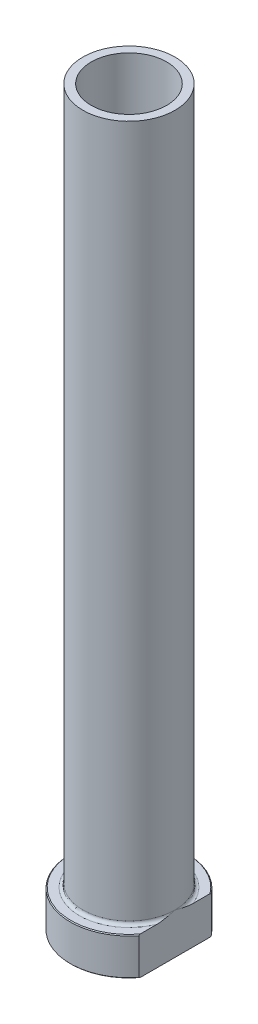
ISO-10303-21;
HEADER;
FILE_DESCRIPTION(('STEP AP214'),'2;1');
FILE_NAME('part.step','',(''),(''),'','','');
FILE_SCHEMA(('AUTOMOTIVE_DESIGN { 1 0 10303 214 1 1 1 1 }'));
ENDSEC;
DATA;
#1=APPLICATION_CONTEXT('core data for automotive mechanical design processes');
#2=APPLICATION_PROTOCOL_DEFINITION('international standard','automotive_design',2000,#1);
#3=PRODUCT_CONTEXT('',#1,'mechanical');
#4=PRODUCT('Part','Part','',(#3));
#5=PRODUCT_RELATED_PRODUCT_CATEGORY('part','',(#4));
#6=PRODUCT_DEFINITION_FORMATION('','',#4);
#7=PRODUCT_DEFINITION_CONTEXT('part definition',#1,'design');
#8=PRODUCT_DEFINITION('design','',#6,#7);
#9=PRODUCT_DEFINITION_SHAPE('','',#8);
#10=(LENGTH_UNIT() NAMED_UNIT(*) SI_UNIT(.MILLI.,.METRE.));
#11=(NAMED_UNIT(*) PLANE_ANGLE_UNIT() SI_UNIT($,.RADIAN.));
#12=(NAMED_UNIT(*) SI_UNIT($,.STERADIAN.) SOLID_ANGLE_UNIT());
#13=UNCERTAINTY_MEASURE_WITH_UNIT(LENGTH_MEASURE(1.E-05),#10,'distance_accuracy_value','');
#14=(GEOMETRIC_REPRESENTATION_CONTEXT(3) GLOBAL_UNCERTAINTY_ASSIGNED_CONTEXT((#13)) GLOBAL_UNIT_ASSIGNED_CONTEXT((#10,
#11,#12)) REPRESENTATION_CONTEXT('',''));
#15=CARTESIAN_POINT('',(0.,0.,0.));
#16=DIRECTION('',(0.,0.,1.));
#17=DIRECTION('',(1.,0.,0.));
#18=AXIS2_PLACEMENT_3D('',#15,#16,#17);
#19=CARTESIAN_POINT('',(0.,92.1876809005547,0.));
#20=DIRECTION('',(0.,1.,0.));
#21=DIRECTION('',(0.,0.,1.));
#22=AXIS2_PLACEMENT_3D('',#19,#20,#21);
#23=CYLINDRICAL_SURFACE('',#22,9.);
#24=CARTESIAN_POINT('',(0.,175.,0.));
#25=DIRECTION('',(0.,1.,0.));
#26=DIRECTION('',(0.,0.,1.));
#27=AXIS2_PLACEMENT_3D('',#24,#25,#26);
#28=CIRCLE('',#27,9.);
#29=CARTESIAN_POINT('',(0.,175.,9.));
#30=VERTEX_POINT('',#29);
#31=EDGE_CURVE('E167',#30,#30,#28,.T.);
#32=ORIENTED_EDGE('',*,*,#31,.T.);
#33=EDGE_LOOP('',(#32));
#34=FACE_BOUND('',#33,.T.);
#35=CARTESIAN_POINT('',(0.,120.,0.));
#36=DIRECTION('',(0.,1.,0.));
#37=DIRECTION('',(0.,0.,1.));
#38=AXIS2_PLACEMENT_3D('',#35,#36,#37);
#39=CIRCLE('',#38,9.);
#40=CARTESIAN_POINT('',(0.,120.,9.));
#41=VERTEX_POINT('',#40);
#42=EDGE_CURVE('E170',#41,#41,#39,.T.);
#43=ORIENTED_EDGE('',*,*,#42,.F.);
#44=EDGE_LOOP('',(#43));
#45=FACE_BOUND('',#44,.T.);
#46=ADVANCED_FACE('F32',(#34,#45),#23,.F.);
#47=CARTESIAN_POINT('',(-9.,175.,0.));
#48=DIRECTION('',(0.,1.,0.));
#49=DIRECTION('',(0.,0.,1.));
#50=AXIS2_PLACEMENT_3D('',#47,#48,#49);
#51=PLANE('',#50);
#52=CARTESIAN_POINT('',(0.,175.,0.));
#53=DIRECTION('',(0.,1.,0.));
#54=DIRECTION('',(0.,0.,1.));
#55=AXIS2_PLACEMENT_3D('',#52,#53,#54);
#56=CIRCLE('',#55,11.);
#57=CARTESIAN_POINT('',(0.,175.,11.));
#58=VERTEX_POINT('',#57);
#59=EDGE_CURVE('E174',#58,#58,#56,.T.);
#60=ORIENTED_EDGE('',*,*,#59,.T.);
#61=EDGE_LOOP('',(#60));
#62=FACE_BOUND('',#61,.T.);
#63=ORIENTED_EDGE('',*,*,#31,.F.);
#64=EDGE_LOOP('',(#63));
#65=FACE_BOUND('',#64,.T.);
#66=ADVANCED_FACE('F157',(#62,#65),#51,.T.);
#67=CARTESIAN_POINT('',(0.,92.1876809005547,0.));
#68=DIRECTION('',(0.,1.,0.));
#69=DIRECTION('',(0.,0.,1.));
#70=AXIS2_PLACEMENT_3D('',#67,#68,#69);
#71=CYLINDRICAL_SURFACE('',#70,11.);
#72=CARTESIAN_POINT('',(0.,9.8,0.));
#73=DIRECTION('',(0.,1.,0.));
#74=DIRECTION('',(0.,0.,1.));
#75=AXIS2_PLACEMENT_3D('',#72,#73,#74);
#76=CIRCLE('',#75,11.);
#77=CARTESIAN_POINT('',(11.,9.8,0.));
#78=VERTEX_POINT('',#77);
#79=EDGE_CURVE('E180',#78,#78,#76,.T.);
#80=ORIENTED_EDGE('',*,*,#79,.T.);
#81=EDGE_LOOP('',(#80));
#82=FACE_BOUND('',#81,.T.);
#83=ORIENTED_EDGE('',*,*,#59,.F.);
#84=EDGE_LOOP('',(#83));
#85=FACE_BOUND('',#84,.T.);
#86=ADVANCED_FACE('F162',(#82,#85),#71,.T.);
#87=CARTESIAN_POINT('',(-11.,9.,0.));
#88=DIRECTION('',(0.,1.,0.));
#89=DIRECTION('',(0.,0.,1.));
#90=AXIS2_PLACEMENT_3D('',#87,#88,#89);
#91=PLANE('',#90);
#92=DIRECTION('',(0.,0.,1.));
#93=VECTOR('',#92,1.);
#94=CARTESIAN_POINT('',(11.,9.,0.));
#95=LINE('',#94,#93);
#96=CARTESIAN_POINT('',(11.,9.,-8.33306666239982));
#97=VERTEX_POINT('',#96);
#98=CARTESIAN_POINT('',(11.,9.,-4.27083130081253));
#99=VERTEX_POINT('',#98);
#100=EDGE_CURVE('E54',#97,#99,#95,.T.);
#101=ORIENTED_EDGE('',*,*,#100,.F.);
#102=CARTESIAN_POINT('',(0.,9.,0.));
#103=DIRECTION('',(0.,1.,0.));
#104=DIRECTION('',(0.,0.,1.));
#105=AXIS2_PLACEMENT_3D('',#102,#103,#104);
#106=CIRCLE('',#105,13.8);
#107=CARTESIAN_POINT('',(11.,9.,8.33306666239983));
#108=VERTEX_POINT('',#107);
#109=EDGE_CURVE('E186',#97,#108,#106,.T.);
#110=ORIENTED_EDGE('',*,*,#109,.T.);
#111=CARTESIAN_POINT('',(11.,9.,4.27083130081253));
#112=VERTEX_POINT('',#111);
#113=EDGE_CURVE('E134',#112,#108,#95,.T.);
#114=ORIENTED_EDGE('',*,*,#113,.F.);
#115=CARTESIAN_POINT('',(0.,9.,0.));
#116=DIRECTION('',(0.,1.,0.));
#117=DIRECTION('',(0.,0.,1.));
#118=AXIS2_PLACEMENT_3D('',#115,#116,#117);
#119=CIRCLE('',#118,11.8);
#120=EDGE_CURVE('E183',#112,#99,#119,.F.);
#121=ORIENTED_EDGE('',*,*,#120,.T.);
#122=EDGE_LOOP('',(#101,#110,#114,#121));
#123=FACE_BOUND('',#122,.T.);
#124=ADVANCED_FACE('F197',(#123),#91,.T.);
#125=CARTESIAN_POINT('',(0.,92.1876809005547,0.));
#126=DIRECTION('',(0.,1.,0.));
#127=DIRECTION('',(0.,0.,1.));
#128=AXIS2_PLACEMENT_3D('',#125,#126,#127);
#129=CYLINDRICAL_SURFACE('',#128,14.);
#130=DIRECTION('',(0.,-1.,0.));
#131=VECTOR('',#130,1.);
#132=CARTESIAN_POINT('',(11.,175.,8.66025403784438));
#133=LINE('',#132,#131);
#134=CARTESIAN_POINT('',(11.,8.8,8.66025403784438));
#135=VERTEX_POINT('',#134);
#136=CARTESIAN_POINT('',(11.,0.200000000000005,8.66025403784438));
#137=VERTEX_POINT('',#136);
#138=EDGE_CURVE('E82',#135,#137,#133,.T.);
#139=ORIENTED_EDGE('',*,*,#138,.F.);
#140=CARTESIAN_POINT('',(0.,8.8,0.));
#141=DIRECTION('',(0.,1.,0.));
#142=DIRECTION('',(0.,0.,1.));
#143=AXIS2_PLACEMENT_3D('',#140,#141,#142);
#144=CIRCLE('',#143,14.);
#145=CARTESIAN_POINT('',(11.,8.8,-8.66025403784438));
#146=VERTEX_POINT('',#145);
#147=EDGE_CURVE('E95',#135,#146,#144,.F.);
#148=ORIENTED_EDGE('',*,*,#147,.T.);
#149=DIRECTION('',(0.,-1.,0.));
#150=VECTOR('',#149,1.);
#151=CARTESIAN_POINT('',(11.,175.,-8.66025403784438));
#152=LINE('',#151,#150);
#153=CARTESIAN_POINT('',(11.,0.200000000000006,-8.66025403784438));
#154=VERTEX_POINT('',#153);
#155=EDGE_CURVE('E192',#146,#154,#152,.T.);
#156=ORIENTED_EDGE('',*,*,#155,.T.);
#157=CARTESIAN_POINT('',(0.,0.200000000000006,0.));
#158=DIRECTION('',(0.,-1.,0.));
#159=DIRECTION('',(0.,0.,-1.));
#160=AXIS2_PLACEMENT_3D('',#157,#158,#159);
#161=CIRCLE('',#160,14.);
#162=EDGE_CURVE('E98',#154,#137,#161,.F.);
#163=ORIENTED_EDGE('',*,*,#162,.T.);
#164=EDGE_LOOP('',(#139,#148,#156,#163));
#165=FACE_BOUND('',#164,.T.);
#166=ADVANCED_FACE('F190',(#165),#129,.T.);
#167=CARTESIAN_POINT('',(-14.,0.,0.));
#168=DIRECTION('',(0.,-1.,0.));
#169=DIRECTION('',(0.,0.,-1.));
#170=AXIS2_PLACEMENT_3D('',#167,#168,#169);
#171=PLANE('',#170);
#172=CARTESIAN_POINT('',(0.,0.,0.));
#173=DIRECTION('',(0.,-1.,0.));
#174=DIRECTION('',(0.,0.,-1.));
#175=AXIS2_PLACEMENT_3D('',#172,#173,#174);
#176=CIRCLE('',#175,9.74999999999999);
#177=CARTESIAN_POINT('',(0.,0.,-9.74999999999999));
#178=VERTEX_POINT('',#177);
#179=EDGE_CURVE('E40',#178,#178,#176,.F.);
#180=ORIENTED_EDGE('',*,*,#179,.T.);
#181=EDGE_LOOP('',(#180));
#182=FACE_BOUND('',#181,.T.);
#183=DIRECTION('',(0.,0.,-1.));
#184=VECTOR('',#183,1.);
#185=CARTESIAN_POINT('',(11.,0.,8.66025403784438));
#186=LINE('',#185,#184);
#187=CARTESIAN_POINT('',(11.,0.,8.33306666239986));
#188=VERTEX_POINT('',#187);
#189=CARTESIAN_POINT('',(11.,0.,-8.33306666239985));
#190=VERTEX_POINT('',#189);
#191=EDGE_CURVE('E47',#188,#190,#186,.T.);
#192=ORIENTED_EDGE('',*,*,#191,.F.);
#193=CARTESIAN_POINT('',(0.,0.,0.));
#194=DIRECTION('',(0.,-1.,0.));
#195=DIRECTION('',(0.,0.,-1.));
#196=AXIS2_PLACEMENT_3D('',#193,#194,#195);
#197=CIRCLE('',#196,13.8);
#198=EDGE_CURVE('E92',#188,#190,#197,.T.);
#199=ORIENTED_EDGE('',*,*,#198,.T.);
#200=EDGE_LOOP('',(#192,#199));
#201=FACE_BOUND('',#200,.T.);
#202=ADVANCED_FACE('F91',(#182,#201),#171,.T.);
#203=CARTESIAN_POINT('',(0.,92.1876809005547,0.));
#204=DIRECTION('',(0.,1.,0.));
#205=DIRECTION('',(0.,0.,1.));
#206=AXIS2_PLACEMENT_3D('',#203,#204,#205);
#207=CYLINDRICAL_SURFACE('',#206,9.25);
#208=CARTESIAN_POINT('',(0.,0.500000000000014,0.));
#209=DIRECTION('',(0.,-1.,0.));
#210=DIRECTION('',(0.,0.,-1.));
#211=AXIS2_PLACEMENT_3D('',#208,#209,#210);
#212=CIRCLE('',#211,9.25);
#213=CARTESIAN_POINT('',(0.,0.500000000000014,-9.25));
#214=VERTEX_POINT('',#213);
#215=EDGE_CURVE('E11',#214,#214,#212,.T.);
#216=ORIENTED_EDGE('',*,*,#215,.T.);
#217=EDGE_LOOP('',(#216));
#218=FACE_BOUND('',#217,.T.);
#219=CARTESIAN_POINT('',(0.,108.,0.));
#220=DIRECTION('',(0.,1.,0.));
#221=DIRECTION('',(0.,0.,1.));
#222=AXIS2_PLACEMENT_3D('',#219,#220,#221);
#223=CIRCLE('',#222,9.25);
#224=CARTESIAN_POINT('',(0.,108.,9.25));
#225=VERTEX_POINT('',#224);
#226=EDGE_CURVE('E172',#225,#225,#223,.T.);
#227=ORIENTED_EDGE('',*,*,#226,.T.);
#228=EDGE_LOOP('',(#227));
#229=FACE_BOUND('',#228,.T.);
#230=ADVANCED_FACE('F215',(#218,#229),#207,.F.);
#231=CARTESIAN_POINT('',(0.,108.,0.));
#232=DIRECTION('',(0.,-1.,0.));
#233=DIRECTION('',(0.,0.,-1.));
#234=AXIS2_PLACEMENT_3D('',#231,#232,#233);
#235=CONICAL_SURFACE('',#234,9.25,0.0208303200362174);
#236=ORIENTED_EDGE('',*,*,#42,.T.);
#237=EDGE_LOOP('',(#236));
#238=FACE_BOUND('',#237,.T.);
#239=ORIENTED_EDGE('',*,*,#226,.F.);
#240=EDGE_LOOP('',(#239));
#241=FACE_BOUND('',#240,.T.);
#242=ADVANCED_FACE('F111',(#238,#241),#235,.F.);
#243=CARTESIAN_POINT('',(0.,9.8,0.));
#244=DIRECTION('',(0.,1.,0.));
#245=DIRECTION('',(0.,0.,1.));
#246=AXIS2_PLACEMENT_3D('',#243,#244,#245);
#247=TOROIDAL_SURFACE('',#246,11.8,0.8);
#248=ORIENTED_EDGE('',*,*,#120,.F.);
#249=CARTESIAN_POINT('',(11.,9.8,0.));
#250=CARTESIAN_POINT('',(11.,9.80000101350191,-1.1690292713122E-10));
#251=CARTESIAN_POINT('',(11.,9.80000202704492,3.62636566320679E-07));
#252=CARTESIAN_POINT('',(11.,9.80000392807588,1.38767028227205E-06));
#253=CARTESIAN_POINT('',(11.,9.80000479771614,2.07263760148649E-06));
#254=CARTESIAN_POINT('',(11.,9.80000659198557,3.71036656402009E-06));
#255=CARTESIAN_POINT('',(11.,9.80000749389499,4.6893019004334E-06));
#256=CARTESIAN_POINT('',(11.,9.80000912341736,6.73011549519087E-06));
#257=CARTESIAN_POINT('',(11.,9.80000985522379,7.78888125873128E-06));
#258=CARTESIAN_POINT('',(11.,9.80001253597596,1.18457651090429E-05));
#259=CARTESIAN_POINT('',(11.,9.80001433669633,1.49465064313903E-05));
#260=CARTESIAN_POINT('',(11.,9.80001733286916,2.11226752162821E-05));
#261=CARTESIAN_POINT('',(11.,9.80001856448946,2.41813354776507E-05));
#262=CARTESIAN_POINT('',(11.,9.80002366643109,3.70013744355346E-05));
#263=CARTESIAN_POINT('',(11.,9.80002742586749,4.68141699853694E-05));
#264=CARTESIAN_POINT('',(11.,9.80003302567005,6.54425655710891E-05));
#265=CARTESIAN_POINT('',(11.,9.80003506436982,7.41984078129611E-05));
#266=CARTESIAN_POINT('',(11.,9.80004981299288,0.000138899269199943));
#267=CARTESIAN_POINT('',(11.,9.80006088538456,0.000195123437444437));
#268=CARTESIAN_POINT('',(11.,9.80010935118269,0.000417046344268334));
#269=CARTESIAN_POINT('',(11.,9.80015570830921,0.0005807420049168));
#270=CARTESIAN_POINT('',(11.,9.80033600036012,0.00122860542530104));
#271=CARTESIAN_POINT('',(11.,9.80046404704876,0.00171390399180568));
#272=CARTESIAN_POINT('',(11.,9.80097655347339,0.00364143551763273));
#273=CARTESIAN_POINT('',(11.,9.8013683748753,0.00508221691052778));
#274=CARTESIAN_POINT('',(11.,9.80300002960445,0.0110983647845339));
#275=CARTESIAN_POINT('',(11.,9.8042306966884,0.0156755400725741));
#276=CARTESIAN_POINT('',(11.,9.8247472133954,0.0919599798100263));
#277=CARTESIAN_POINT('',(11.,9.84411511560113,0.163651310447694));
#278=CARTESIAN_POINT('',(11.,9.8819343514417,0.304144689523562));
#279=CARTESIAN_POINT('',(11.,9.90039088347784,0.372945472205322));
#280=CARTESIAN_POINT('',(11.,9.93953155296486,0.519420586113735));
#281=CARTESIAN_POINT('',(11.,9.96019740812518,0.597099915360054));
#282=CARTESIAN_POINT('',(11.,10.0014716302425,0.753402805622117));
#283=CARTESIAN_POINT('',(11.,10.022076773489,0.832027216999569));
#284=CARTESIAN_POINT('',(11.,10.0569012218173,0.96627646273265));
#285=CARTESIAN_POINT('',(11.,10.0712190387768,1.02187571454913));
#286=CARTESIAN_POINT('',(11.,10.0995828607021,1.13298938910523));
#287=CARTESIAN_POINT('',(11.,10.1136294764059,1.18850365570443));
#288=CARTESIAN_POINT('',(11.,10.1546367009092,1.35225812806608));
#289=CARTESIAN_POINT('',(11.,10.1812165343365,1.46059357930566));
#290=CARTESIAN_POINT('',(11.,10.2669117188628,1.81933910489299));
#291=CARTESIAN_POINT('',(11.,10.3231642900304,2.07044657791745));
#292=CARTESIAN_POINT('',(11.,10.4250125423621,2.57779828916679));
#293=CARTESIAN_POINT('',(11.,10.4704839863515,2.83406864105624));
#294=CARTESIAN_POINT('',(11.,10.527221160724,3.23096220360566));
#295=CARTESIAN_POINT('',(11.,10.5446090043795,3.37070252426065));
#296=CARTESIAN_POINT('',(11.,10.5730475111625,3.65081430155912));
#297=CARTESIAN_POINT('',(11.,10.5840998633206,3.79118557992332));
#298=CARTESIAN_POINT('',(11.,10.5982304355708,4.07161741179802));
#299=CARTESIAN_POINT('',(11.,10.6013499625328,4.21167576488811));
#300=CARTESIAN_POINT('',(11.,10.5975625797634,4.49161919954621));
#301=CARTESIAN_POINT('',(11.,10.5906655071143,4.63150431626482));
#302=CARTESIAN_POINT('',(11.,10.5704363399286,4.8393109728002));
#303=CARTESIAN_POINT('',(11.,10.562146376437,4.9077258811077));
#304=CARTESIAN_POINT('',(11.,10.5417448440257,5.04405523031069));
#305=CARTESIAN_POINT('',(11.,10.5296301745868,5.11196921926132));
#306=CARTESIAN_POINT('',(11.,10.5009997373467,5.24610291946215));
#307=CARTESIAN_POINT('',(11.,10.4845340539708,5.31233305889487));
#308=CARTESIAN_POINT('',(11.,10.4461783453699,5.44314716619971));
#309=CARTESIAN_POINT('',(11.,10.4242944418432,5.50773290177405));
#310=CARTESIAN_POINT('',(11.,10.3734211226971,5.63494480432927));
#311=CARTESIAN_POINT('',(11.,10.3443615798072,5.69754429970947));
#312=CARTESIAN_POINT('',(11.,10.2940125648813,5.78758577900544));
#313=CARTESIAN_POINT('',(11.,10.2761248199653,5.81692841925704));
#314=CARTESIAN_POINT('',(11.,10.2377448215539,5.8738430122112));
#315=CARTESIAN_POINT('',(11.,10.2172553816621,5.90141683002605));
#316=CARTESIAN_POINT('',(11.,10.1754926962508,5.951445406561));
#317=CARTESIAN_POINT('',(11.,10.1545053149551,5.97413611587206));
#318=CARTESIAN_POINT('',(11.,10.1098178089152,6.01675330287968));
#319=CARTESIAN_POINT('',(11.,10.0861159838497,6.0366780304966));
#320=CARTESIAN_POINT('',(11.,10.0355211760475,6.07288913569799));
#321=CARTESIAN_POINT('',(11.,10.0085887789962,6.08912169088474));
#322=CARTESIAN_POINT('',(11.,9.95208821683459,6.11604527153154));
#323=CARTESIAN_POINT('',(11.,9.92252876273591,6.12675386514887));
#324=CARTESIAN_POINT('',(11.,9.87044933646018,6.1391597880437));
#325=CARTESIAN_POINT('',(11.,9.84833164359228,6.14255775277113));
#326=CARTESIAN_POINT('',(11.,9.80383923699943,6.14553082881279));
#327=CARTESIAN_POINT('',(11.,9.78146463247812,6.1451075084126));
#328=CARTESIAN_POINT('',(11.,9.73715415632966,6.14047859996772));
#329=CARTESIAN_POINT('',(11.,9.71521765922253,6.13627886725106));
#330=CARTESIAN_POINT('',(11.,9.672289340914,6.1244663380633));
#331=CARTESIAN_POINT('',(11.,9.65129820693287,6.11685110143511));
#332=CARTESIAN_POINT('',(11.,9.60293880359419,6.09531376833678));
#333=CARTESIAN_POINT('',(11.,9.57614979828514,6.08009633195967));
#334=CARTESIAN_POINT('',(11.,9.52533680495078,6.04559207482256));
#335=CARTESIAN_POINT('',(11.,9.50131971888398,6.02629542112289));
#336=CARTESIAN_POINT('',(11.,9.44252607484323,5.97248581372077));
#337=CARTESIAN_POINT('',(11.,9.40981527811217,5.93573547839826));
#338=CARTESIAN_POINT('',(11.,9.35019076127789,5.85789950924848));
#339=CARTESIAN_POINT('',(11.,9.32328591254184,5.81680738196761));
#340=CARTESIAN_POINT('',(11.,9.27531247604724,5.7338200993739));
#341=CARTESIAN_POINT('',(11.,9.25403723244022,5.69204233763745));
#342=CARTESIAN_POINT('',(11.,9.21507165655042,5.60682590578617));
#343=CARTESIAN_POINT('',(11.,9.19738479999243,5.5633856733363));
#344=CARTESIAN_POINT('',(11.,9.16492416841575,5.47505507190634));
#345=CARTESIAN_POINT('',(11.,9.15017444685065,5.43015597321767));
#346=CARTESIAN_POINT('',(11.,9.12332484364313,5.33960740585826));
#347=CARTESIAN_POINT('',(11.,9.11122363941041,5.29395832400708));
#348=CARTESIAN_POINT('',(11.,9.08512909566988,5.18461425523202));
#349=CARTESIAN_POINT('',(11.,9.07217244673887,5.12067246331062));
#350=CARTESIAN_POINT('',(11.,9.04991113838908,4.99214785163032));
#351=CARTESIAN_POINT('',(11.,9.0406080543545,4.92756476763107));
#352=CARTESIAN_POINT('',(11.,9.01731839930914,4.7329421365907));
#353=CARTESIAN_POINT('',(11.,9.008018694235,4.60233754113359));
#354=CARTESIAN_POINT('',(11.,8.99902947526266,4.34550193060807));
#355=CARTESIAN_POINT('',(11.,8.99901276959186,4.21927902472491));
#356=CARTESIAN_POINT('',(11.,9.00595929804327,3.96771196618));
#357=CARTESIAN_POINT('',(11.,9.01288556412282,3.84236670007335));
#358=CARTESIAN_POINT('',(11.,9.0330741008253,3.58284783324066));
#359=CARTESIAN_POINT('',(11.,9.04676832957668,3.4487092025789));
#360=CARTESIAN_POINT('',(11.,9.07939011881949,3.18114709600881));
#361=CARTESIAN_POINT('',(11.,9.09831526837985,3.04772331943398));
#362=CARTESIAN_POINT('',(11.,9.14092023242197,2.77842123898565));
#363=CARTESIAN_POINT('',(11.,9.16470161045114,2.64255921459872));
#364=CARTESIAN_POINT('',(11.,9.21593088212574,2.37116504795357));
#365=CARTESIAN_POINT('',(11.,9.24338827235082,2.23563471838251));
#366=CARTESIAN_POINT('',(11.,9.31183649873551,1.91532204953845));
#367=CARTESIAN_POINT('',(11.,9.35408384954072,1.73080986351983));
#368=CARTESIAN_POINT('',(11.,9.4418414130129,1.36477440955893));
#369=CARTESIAN_POINT('',(11.,9.48730948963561,1.18324089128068));
#370=CARTESIAN_POINT('',(11.,9.55452451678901,0.921934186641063));
#371=CARTESIAN_POINT('',(11.,9.57534575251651,0.841920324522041));
#372=CARTESIAN_POINT('',(11.,9.61742284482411,0.681633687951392));
#373=CARTESIAN_POINT('',(11.,9.63868020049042,0.601361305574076));
#374=CARTESIAN_POINT('',(11.,9.68246779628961,0.43691647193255));
#375=CARTESIAN_POINT('',(11.,9.7050090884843,0.352747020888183));
#376=CARTESIAN_POINT('',(11.,9.74991333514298,0.185809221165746));
#377=CARTESIAN_POINT('',(11.,9.77227331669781,0.10304013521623));
#378=CARTESIAN_POINT('',(11.,9.79577053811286,0.0156708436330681));
#379=CARTESIAN_POINT('',(11.,9.79700248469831,0.0110889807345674));
#380=CARTESIAN_POINT('',(11.,9.79863444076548,0.00507176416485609));
#381=CARTESIAN_POINT('',(11.,9.79902527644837,0.00363459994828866));
#382=CARTESIAN_POINT('',(11.,9.7995365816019,0.00171158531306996));
#383=CARTESIAN_POINT('',(11.,9.79966439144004,0.00122718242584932));
#384=CARTESIAN_POINT('',(11.,9.79984439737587,0.000580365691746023));
#385=CARTESIAN_POINT('',(11.,9.79989071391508,0.000416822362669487));
#386=CARTESIAN_POINT('',(11.,9.79993914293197,0.00019507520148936));
#387=CARTESIAN_POINT('',(11.,9.79995021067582,0.000138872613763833));
#388=CARTESIAN_POINT('',(11.,9.7999649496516,7.41937202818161E-05));
#389=CARTESIAN_POINT('',(11.,9.79996698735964,6.54390964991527E-05));
#390=CARTESIAN_POINT('',(11.,9.79997258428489,4.68131817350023E-05));
#391=CARTESIAN_POINT('',(11.,9.79997634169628,3.70015839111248E-05));
#392=CARTESIAN_POINT('',(11.,9.79998144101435,2.41827810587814E-05));
#393=CARTESIAN_POINT('',(11.,9.799982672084,2.11242119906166E-05));
#394=CARTESIAN_POINT('',(11.,9.79998566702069,1.49481332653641E-05));
#395=CARTESIAN_POINT('',(11.,9.79998746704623,1.18473797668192E-05));
#396=CARTESIAN_POINT('',(11.,9.79999014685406,7.79037164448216E-06));
#397=CARTESIAN_POINT('',(11.,9.79999087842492,6.73154374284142E-06));
#398=CARTESIAN_POINT('',(11.,9.79999250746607,4.69056335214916E-06));
#399=CARTESIAN_POINT('',(11.,9.79999340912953,3.71152195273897E-06));
#400=CARTESIAN_POINT('',(11.,9.79999520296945,2.07354290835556E-06));
#401=CARTESIAN_POINT('',(11.,9.79999607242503,1.38844064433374E-06));
#402=CARTESIAN_POINT('',(11.,9.79999797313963,3.63067529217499E-07));
#403=CARTESIAN_POINT('',(11.,9.79999898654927,1.16901430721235E-10));
#404=CARTESIAN_POINT('',(11.,9.8,0.));
#405=B_SPLINE_CURVE_WITH_KNOTS('',3,(#249,#250,#251,#252,#253,#254,#255,#256,#257,#258,#259,
#260,#261,#262,#263,#264,#265,#266,#267,#268,#269,#270,#271,#272,#273,#274,#275,#276,#277,#278,
#279,#280,#281,#282,#283,#284,#285,#286,#287,#288,#289,#290,#291,#292,#293,#294,#295,#296,#297,
#298,#299,#300,#301,#302,#303,#304,#305,#306,#307,#308,#309,#310,#311,#312,#313,#314,#315,#316,
#317,#318,#319,#320,#321,#322,#323,#324,#325,#326,#327,#328,#329,#330,#331,#332,#333,#334,#335,
#336,#337,#338,#339,#340,#341,#342,#343,#344,#345,#346,#347,#348,#349,#350,#351,#352,#353,#354,
#355,#356,#357,#358,#359,#360,#361,#362,#363,#364,#365,#366,#367,#368,#369,#370,#371,#372,#373,
#374,#375,#376,#377,#378,#379,#380,#381,#382,#383,#384,#385,#386,#387,#388,#389,#390,#391,#392,
#393,#394,#395,#396,#397,#398,#399,#400,#401,#402,#403,#404),.UNSPECIFIED.,.T.,.F.,(4,2,2,2,2,2,
2,2,2,2,2,2,2,2,2,2,2,2,2,2,2,2,2,2,2,2,2,2,2,2,2,2,2,2,2,2,2,2,2,2,2,2,2,2,2,2,2,2,2,2,2,2,2,2,
2,2,2,2,2,2,2,2,2,2,2,2,2,2,2,2,2,2,2,2,2,2,2,4),(0.,3.06076166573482E-06,6.37973648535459E-06,
1.03502682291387E-05,1.42089742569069E-05,2.49252578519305E-05,3.48085573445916E-05,
6.62739409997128E-05,9.3210446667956E-05,0.00026516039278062,0.00077503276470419,
0.00228129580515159,0.00675996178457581,0.0209798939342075,0.24375656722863,0.457458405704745,
0.698601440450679,0.942439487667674,1.11467870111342,1.28646938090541,1.62111125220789,
2.39296447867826,3.17332138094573,3.59566656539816,4.01789910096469,4.43792849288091,
4.85754566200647,5.06420795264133,5.27103820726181,5.47558418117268,5.67990009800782,
5.88629782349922,5.98928489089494,6.09216151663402,6.18469603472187,6.27728883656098,
6.37115541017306,6.46472158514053,6.53154940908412,6.59834980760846,6.66504681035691,
6.73179153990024,6.82369899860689,6.91583057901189,7.06259901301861,7.20959014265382,
7.35003074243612,7.49060673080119,7.63229046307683,7.7739032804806,7.96948934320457,
8.16515964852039,8.5574426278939,8.9358981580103,9.31234923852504,9.7167301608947,
10.1209250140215,10.5346477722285,10.9494607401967,11.5172595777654,12.078659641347,
12.3266950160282,12.5758117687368,12.8372206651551,13.0944202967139,13.1086548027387,
13.1131222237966,13.1146257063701,13.1151351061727,13.1153069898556,13.1153339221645,
13.1153653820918,13.1153752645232,13.115385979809,13.1153898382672,13.1153938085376,
13.1153971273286,13.1154001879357),.UNSPECIFIED.);
#406=EDGE_CURVE('E126',#112,#78,#405,.T.);
#407=ORIENTED_EDGE('',*,*,#406,.T.);
#408=ORIENTED_EDGE('',*,*,#79,.F.);
#409=CARTESIAN_POINT('',(11.,9.8,0.));
#410=CARTESIAN_POINT('',(11.,9.79999898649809,1.16907086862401E-10));
#411=CARTESIAN_POINT('',(11.,9.79999797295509,-3.62636562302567E-07));
#412=CARTESIAN_POINT('',(11.,9.79999607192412,-1.38767027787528E-06));
#413=CARTESIAN_POINT('',(11.,9.79999520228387,-2.07263759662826E-06));
#414=CARTESIAN_POINT('',(11.,9.79999340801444,-3.71036655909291E-06));
#415=CARTESIAN_POINT('',(11.,9.79999250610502,-4.68930189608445E-06));
#416=CARTESIAN_POINT('',(11.,9.79999087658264,-6.73011549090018E-06));
#417=CARTESIAN_POINT('',(11.,9.79999014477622,-7.78888125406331E-06));
#418=CARTESIAN_POINT('',(11.,9.79998746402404,-1.18457651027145E-05));
#419=CARTESIAN_POINT('',(11.,9.79998566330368,-1.49465064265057E-05));
#420=CARTESIAN_POINT('',(11.,9.79998266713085,-2.11226752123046E-05));
#421=CARTESIAN_POINT('',(11.,9.79998143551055,-2.41813354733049E-05));
#422=CARTESIAN_POINT('',(11.,9.79997633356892,-3.7001374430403E-05));
#423=CARTESIAN_POINT('',(11.,9.79997257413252,-4.68141699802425E-05));
#424=CARTESIAN_POINT('',(11.,9.79996697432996,-6.5442565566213E-05));
#425=CARTESIAN_POINT('',(11.,9.79996493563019,-7.4198407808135E-05));
#426=CARTESIAN_POINT('',(11.,9.79995018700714,-0.000138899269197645));
#427=CARTESIAN_POINT('',(11.,9.79993911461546,-0.000195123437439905));
#428=CARTESIAN_POINT('',(11.,9.7998906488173,-0.000417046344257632));
#429=CARTESIAN_POINT('',(11.,9.7998442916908,-0.000580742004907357));
#430=CARTESIAN_POINT('',(11.,9.79966399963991,-0.00122860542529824));
#431=CARTESIAN_POINT('',(11.,9.79953595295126,-0.00171390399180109));
#432=CARTESIAN_POINT('',(11.,9.79902344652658,-0.00364143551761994));
#433=CARTESIAN_POINT('',(11.,9.79863162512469,-0.00508221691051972));
#434=CARTESIAN_POINT('',(11.,9.79699997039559,-0.0110983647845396));
#435=CARTESIAN_POINT('',(11.,9.79576930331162,-0.0156755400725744));
#436=CARTESIAN_POINT('',(10.9999999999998,9.77525278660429,-0.0919599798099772));
#437=CARTESIAN_POINT('',(11.,9.75588488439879,-0.163651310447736));
#438=CARTESIAN_POINT('',(11.,9.71806564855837,-0.304144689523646));
#439=CARTESIAN_POINT('',(11.,9.69960911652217,-0.372945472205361));
#440=CARTESIAN_POINT('',(11.,9.66046844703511,-0.519420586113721));
#441=CARTESIAN_POINT('',(11.,9.63980259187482,-0.597099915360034));
#442=CARTESIAN_POINT('',(11.,9.59852836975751,-0.753402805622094));
#443=CARTESIAN_POINT('',(11.,9.57792322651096,-0.832027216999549));
#444=CARTESIAN_POINT('',(11.,9.54309877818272,-0.966276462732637));
#445=CARTESIAN_POINT('',(11.,9.52878096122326,-1.02187571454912));
#446=CARTESIAN_POINT('',(11.,9.50041713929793,-1.13298938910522));
#447=CARTESIAN_POINT('',(11.,9.48637052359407,-1.18850365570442));
#448=CARTESIAN_POINT('',(11.,9.44536329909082,-1.35225812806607));
#449=CARTESIAN_POINT('',(11.,9.41878346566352,-1.46059357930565));
#450=CARTESIAN_POINT('',(11.,9.33308828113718,-1.81933910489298));
#451=CARTESIAN_POINT('',(11.,9.27683570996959,-2.07044657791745));
#452=CARTESIAN_POINT('',(11.,9.17498745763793,-2.5777982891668));
#453=CARTESIAN_POINT('',(11.,9.12951601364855,-2.83406864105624));
#454=CARTESIAN_POINT('',(11.,9.07277883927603,-3.23096220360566));
#455=CARTESIAN_POINT('',(11.,9.05539099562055,-3.37070252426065));
#456=CARTESIAN_POINT('',(11.,9.02695248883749,-3.65081430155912));
#457=CARTESIAN_POINT('',(11.,9.01590013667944,-3.79118557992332));
#458=CARTESIAN_POINT('',(11.,9.00176956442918,-4.07161741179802));
#459=CARTESIAN_POINT('',(11.,8.99865003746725,-4.21167576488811));
#460=CARTESIAN_POINT('',(11.,9.00243742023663,-4.49161919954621));
#461=CARTESIAN_POINT('',(11.,9.00933449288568,-4.63150431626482));
#462=CARTESIAN_POINT('',(11.,9.02956366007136,-4.8393109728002));
#463=CARTESIAN_POINT('',(11.,9.03785362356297,-4.90772588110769));
#464=CARTESIAN_POINT('',(11.,9.05825515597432,-5.04405523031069));
#465=CARTESIAN_POINT('',(11.,9.07036982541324,-5.11196921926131));
#466=CARTESIAN_POINT('',(11.,9.09900026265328,-5.24610291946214));
#467=CARTESIAN_POINT('',(11.,9.1154659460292,-5.31233305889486));
#468=CARTESIAN_POINT('',(11.,9.15382165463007,-5.4431471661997));
#469=CARTESIAN_POINT('',(11.,9.17570555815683,-5.50773290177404));
#470=CARTESIAN_POINT('',(11.,9.22657887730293,-5.63494480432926));
#471=CARTESIAN_POINT('',(11.,9.25563842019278,-5.69754429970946));
#472=CARTESIAN_POINT('',(11.,9.30598743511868,-5.78758577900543));
#473=CARTESIAN_POINT('',(11.,9.3238751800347,-5.81692841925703));
#474=CARTESIAN_POINT('',(11.,9.36225517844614,-5.87384301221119));
#475=CARTESIAN_POINT('',(11.,9.38274461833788,-5.90141683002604));
#476=CARTESIAN_POINT('',(11.,9.42450730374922,-5.95144540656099));
#477=CARTESIAN_POINT('',(11.,9.44549468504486,-5.97413611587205));
#478=CARTESIAN_POINT('',(11.,9.4901821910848,-6.01675330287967));
#479=CARTESIAN_POINT('',(11.,9.51388401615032,-6.03667803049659));
#480=CARTESIAN_POINT('',(11.,9.56447882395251,-6.07288913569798));
#481=CARTESIAN_POINT('',(11.,9.59141122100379,-6.08912169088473));
#482=CARTESIAN_POINT('',(11.,9.64791178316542,-6.11604527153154));
#483=CARTESIAN_POINT('',(11.,9.6774712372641,-6.12675386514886));
#484=CARTESIAN_POINT('',(11.,9.72955066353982,-6.1391597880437));
#485=CARTESIAN_POINT('',(11.,9.75166835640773,-6.14255775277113));
#486=CARTESIAN_POINT('',(11.,9.79616076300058,-6.14553082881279));
#487=CARTESIAN_POINT('',(11.,9.81853536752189,-6.1451075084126));
#488=CARTESIAN_POINT('',(11.,9.86284584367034,-6.14047859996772));
#489=CARTESIAN_POINT('',(11.,9.88478234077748,-6.13627886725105));
#490=CARTESIAN_POINT('',(11.,9.92771065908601,-6.12446633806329));
#491=CARTESIAN_POINT('',(11.,9.94870179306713,-6.11685110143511));
#492=CARTESIAN_POINT('',(11.,9.99706119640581,-6.09531376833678));
#493=CARTESIAN_POINT('',(11.,10.0238502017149,-6.08009633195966));
#494=CARTESIAN_POINT('',(11.,10.0746631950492,-6.04559207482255));
#495=CARTESIAN_POINT('',(11.,10.098680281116,-6.02629542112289));
#496=CARTESIAN_POINT('',(11.,10.1574739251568,-5.97248581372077));
#497=CARTESIAN_POINT('',(11.,10.1901847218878,-5.93573547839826));
#498=CARTESIAN_POINT('',(11.,10.2498092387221,-5.85789950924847));
#499=CARTESIAN_POINT('',(11.,10.2767140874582,-5.8168073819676));
#500=CARTESIAN_POINT('',(11.,10.3246875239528,-5.73382009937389));
#501=CARTESIAN_POINT('',(11.,10.3459627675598,-5.69204233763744));
#502=CARTESIAN_POINT('',(11.,10.3849283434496,-5.60682590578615));
#503=CARTESIAN_POINT('',(11.,10.4026152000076,-5.56338567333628));
#504=CARTESIAN_POINT('',(11.,10.4350758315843,-5.47505507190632));
#505=CARTESIAN_POINT('',(11.,10.4498255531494,-5.43015597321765));
#506=CARTESIAN_POINT('',(11.,10.4766751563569,-5.33960740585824));
#507=CARTESIAN_POINT('',(11.,10.4887763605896,-5.29395832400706));
#508=CARTESIAN_POINT('',(11.,10.5148709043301,-5.184614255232));
#509=CARTESIAN_POINT('',(11.,10.5278275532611,-5.1206724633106));
#510=CARTESIAN_POINT('',(11.,10.5500888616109,-4.99214785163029));
#511=CARTESIAN_POINT('',(11.,10.5593919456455,-4.92756476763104));
#512=CARTESIAN_POINT('',(11.,10.5826816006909,-4.73294213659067));
#513=CARTESIAN_POINT('',(11.,10.591981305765,-4.60233754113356));
#514=CARTESIAN_POINT('',(11.,10.6009705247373,-4.34550193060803));
#515=CARTESIAN_POINT('',(11.,10.6009872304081,-4.21927902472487));
#516=CARTESIAN_POINT('',(11.,10.5940407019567,-3.96771196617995));
#517=CARTESIAN_POINT('',(11.,10.5871144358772,-3.8423667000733));
#518=CARTESIAN_POINT('',(11.,10.5669258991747,-3.5828478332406));
#519=CARTESIAN_POINT('',(11.,10.5532316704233,-3.44870920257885));
#520=CARTESIAN_POINT('',(11.,10.5206098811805,-3.18114709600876));
#521=CARTESIAN_POINT('',(11.,10.5016847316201,-3.04772331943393));
#522=CARTESIAN_POINT('',(11.,10.459079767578,-2.77842123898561));
#523=CARTESIAN_POINT('',(11.,10.4352983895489,-2.64255921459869));
#524=CARTESIAN_POINT('',(11.,10.3840691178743,-2.37116504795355));
#525=CARTESIAN_POINT('',(11.,10.3566117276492,-2.23563471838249));
#526=CARTESIAN_POINT('',(11.,10.2881635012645,-1.91532204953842));
#527=CARTESIAN_POINT('',(11.,10.2459161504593,-1.73080986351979));
#528=CARTESIAN_POINT('',(11.,10.1581585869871,-1.36477440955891));
#529=CARTESIAN_POINT('',(11.,10.1126905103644,-1.18324089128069));
#530=CARTESIAN_POINT('',(11.,10.045475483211,-0.921934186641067));
#531=CARTESIAN_POINT('',(11.,10.0246542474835,-0.841920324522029));
#532=CARTESIAN_POINT('',(11.,9.98257715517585,-0.681633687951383));
#533=CARTESIAN_POINT('',(11.,9.96131979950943,-0.601361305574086));
#534=CARTESIAN_POINT('',(11.,9.91753220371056,-0.436916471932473));
#535=CARTESIAN_POINT('',(11.,9.89499091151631,-0.352747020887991));
#536=CARTESIAN_POINT('',(11.,9.85008666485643,-0.185809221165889));
#537=CARTESIAN_POINT('',(11.,9.82772668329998,-0.103040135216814));
#538=CARTESIAN_POINT('',(11.,9.80422946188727,-0.0156708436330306));
#539=CARTESIAN_POINT('',(11.,9.80299751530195,-0.0110889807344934));
#540=CARTESIAN_POINT('',(11.,9.80136555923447,-0.00507176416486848));
#541=CARTESIAN_POINT('',(11.,9.80097472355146,-0.00363459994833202));
#542=CARTESIAN_POINT('',(11.,9.80046341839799,-0.00171158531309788));
#543=CARTESIAN_POINT('',(11.,9.80033560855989,-0.00122718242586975));
#544=CARTESIAN_POINT('',(11.,9.80015560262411,-0.000580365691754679));
#545=CARTESIAN_POINT('',(11.,9.80010928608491,-0.000416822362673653));
#546=CARTESIAN_POINT('',(11.,9.80006085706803,-0.00019507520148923));
#547=CARTESIAN_POINT('',(11.,9.80004978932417,-0.000138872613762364));
#548=CARTESIAN_POINT('',(11.,9.8000350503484,-7.4193720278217E-05));
#549=CARTESIAN_POINT('',(11.,9.80003301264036,-6.54390964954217E-05));
#550=CARTESIAN_POINT('',(11.,9.80002741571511,-4.68131817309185E-05));
#551=CARTESIAN_POINT('',(11.,9.80002365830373,-3.70015839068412E-05));
#552=CARTESIAN_POINT('',(11.,9.80001855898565,-2.41827810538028E-05));
#553=CARTESIAN_POINT('',(11.,9.800017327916,-2.11242119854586E-05));
#554=CARTESIAN_POINT('',(11.,9.80001433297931,-1.49481332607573E-05));
#555=CARTESIAN_POINT('',(11.,9.80001253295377,-1.1847379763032E-05));
#556=CARTESIAN_POINT('',(11.,9.80000985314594,-7.79037163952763E-06));
#557=CARTESIAN_POINT('',(11.,9.80000912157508,-6.73154373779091E-06));
#558=CARTESIAN_POINT('',(11.,9.80000749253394,-4.69056334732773E-06));
#559=CARTESIAN_POINT('',(11.,9.80000659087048,-3.71152194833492E-06));
#560=CARTESIAN_POINT('',(11.,9.80000479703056,-2.07354290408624E-06));
#561=CARTESIAN_POINT('',(11.,9.80000392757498,-1.38844063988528E-06));
#562=CARTESIAN_POINT('',(11.,9.80000202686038,-3.63067524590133E-07));
#563=CARTESIAN_POINT('',(11.,9.80000101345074,-1.16896776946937E-10));
#564=CARTESIAN_POINT('',(11.,9.8,0.));
#565=B_SPLINE_CURVE_WITH_KNOTS('',3,(#409,#410,#411,#412,#413,#414,#415,#416,#417,#418,#419,
#420,#421,#422,#423,#424,#425,#426,#427,#428,#429,#430,#431,#432,#433,#434,#435,#436,#437,#438,
#439,#440,#441,#442,#443,#444,#445,#446,#447,#448,#449,#450,#451,#452,#453,#454,#455,#456,#457,
#458,#459,#460,#461,#462,#463,#464,#465,#466,#467,#468,#469,#470,#471,#472,#473,#474,#475,#476,
#477,#478,#479,#480,#481,#482,#483,#484,#485,#486,#487,#488,#489,#490,#491,#492,#493,#494,#495,
#496,#497,#498,#499,#500,#501,#502,#503,#504,#505,#506,#507,#508,#509,#510,#511,#512,#513,#514,
#515,#516,#517,#518,#519,#520,#521,#522,#523,#524,#525,#526,#527,#528,#529,#530,#531,#532,#533,
#534,#535,#536,#537,#538,#539,#540,#541,#542,#543,#544,#545,#546,#547,#548,#549,#550,#551,#552,
#553,#554,#555,#556,#557,#558,#559,#560,#561,#562,#563,#564),.UNSPECIFIED.,.T.,.F.,(4,2,2,2,2,2,
2,2,2,2,2,2,2,2,2,2,2,2,2,2,2,2,2,2,2,2,2,2,2,2,2,2,2,2,2,2,2,2,2,2,2,2,2,2,2,2,2,2,2,2,2,2,2,2,
2,2,2,2,2,2,2,2,2,2,2,2,2,2,2,2,2,2,2,2,2,2,2,4),(0.,3.06076166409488E-06,6.37973648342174E-06,
1.03502682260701E-05,1.42089742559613E-05,2.49252578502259E-05,3.48085573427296E-05,
6.62739409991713E-05,9.32104466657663E-05,0.000265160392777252,0.000775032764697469,
0.00228129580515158,0.00675996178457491,0.0209798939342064,0.243756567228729,0.457458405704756,
0.698601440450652,0.942439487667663,1.11467870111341,1.2864693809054,1.62111125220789,
2.39296447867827,3.17332138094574,3.59566656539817,4.01789910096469,4.43792849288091,
4.85754566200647,5.06420795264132,5.2710382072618,5.47558418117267,5.67990009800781,
5.88629782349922,5.98928489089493,6.09216151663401,6.18469603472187,6.27728883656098,
6.37115541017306,6.46472158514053,6.53154940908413,6.59834980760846,6.66504681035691,
6.73179153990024,6.82369899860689,6.91583057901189,7.06259901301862,7.20959014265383,
7.35003074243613,7.4906067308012,7.63229046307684,7.77390328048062,7.96948934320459,
8.16515964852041,8.55744262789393,8.93589815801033,9.31234923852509,9.71673016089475,
10.1209250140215,10.5346477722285,10.9494607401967,11.5172595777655,12.078659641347,
12.3266950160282,12.5758117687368,12.8372206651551,13.0944202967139,13.1086548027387,
13.1131222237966,13.1146257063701,13.1151351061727,13.1153069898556,13.1153339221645,
13.1153653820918,13.1153752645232,13.115385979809,13.1153898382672,13.1153938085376,
13.1153971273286,13.1154001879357),.UNSPECIFIED.);
#566=EDGE_CURVE('E135',#78,#99,#565,.T.);
#567=ORIENTED_EDGE('',*,*,#566,.T.);
#568=EDGE_LOOP('',(#248,#407,#408,#567));
#569=FACE_BOUND('',#568,.T.);
#570=ADVANCED_FACE('F141',(#569),#247,.F.);
#571=CARTESIAN_POINT('',(0.,8.99999999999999,0.));
#572=DIRECTION('',(0.,-1.,0.));
#573=DIRECTION('',(0.,0.,-1.));
#574=AXIS2_PLACEMENT_3D('',#571,#572,#573);
#575=CONICAL_SURFACE('',#574,13.8,0.785398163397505);
#576=CARTESIAN_POINT('',(11.,0.799226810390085,-19.0534516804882));
#577=CARTESIAN_POINT('',(11.,1.04353773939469,-18.7713380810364));
#578=CARTESIAN_POINT('',(11.,1.28708512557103,-18.4885613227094));
#579=CARTESIAN_POINT('',(11.,1.77243087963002,-17.9215029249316));
#580=CARTESIAN_POINT('',(11.,2.0142292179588,-17.6372212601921));
#581=CARTESIAN_POINT('',(11.,2.49596158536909,-17.0668479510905));
#582=CARTESIAN_POINT('',(11.,2.73589466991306,-16.7807555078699));
#583=CARTESIAN_POINT('',(11.,3.21348992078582,-16.206686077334));
#584=CARTESIAN_POINT('',(11.,3.45115209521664,-15.9187090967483));
#585=CARTESIAN_POINT('',(11.,4.17136254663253,-15.0380400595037));
#586=CARTESIAN_POINT('',(11.,4.64980550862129,-14.4419631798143));
#587=CARTESIAN_POINT('',(11.,5.35642548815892,-13.5393158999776));
#588=CARTESIAN_POINT('',(11.,5.59010018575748,-13.2370444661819));
#589=CARTESIAN_POINT('',(11.,6.05311937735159,-12.6292064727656));
#590=CARTESIAN_POINT('',(11.,6.28246396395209,-12.3236399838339));
#591=CARTESIAN_POINT('',(11.,6.7363535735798,-11.7082856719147));
#592=CARTESIAN_POINT('',(11.,6.96089131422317,-11.3984924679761));
#593=CARTESIAN_POINT('',(11.,7.40382501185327,-10.7745304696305));
#594=CARTESIAN_POINT('',(11.,7.62222089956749,-10.4603616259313));
#595=CARTESIAN_POINT('',(11.,8.0517844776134,-9.82670701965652));
#596=CARTESIAN_POINT('',(11.,8.26294571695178,-9.50721687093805));
#597=CARTESIAN_POINT('',(11.,8.67621603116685,-8.8624224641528));
#598=CARTESIAN_POINT('',(11.,8.87832530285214,-8.53711833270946));
#599=CARTESIAN_POINT('',(11.,9.26987187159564,-7.88242741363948));
#600=CARTESIAN_POINT('',(11.,9.45939671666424,-7.55309323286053));
#601=CARTESIAN_POINT('',(11.,9.82494403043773,-6.88691791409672));
#602=CARTESIAN_POINT('',(11.,10.0009648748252,-6.55007587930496));
#603=CARTESIAN_POINT('',(11.,10.3359584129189,-5.86858126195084));
#604=CARTESIAN_POINT('',(11.,10.4949563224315,-5.52394117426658));
#605=CARTESIAN_POINT('',(11.,10.7921156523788,-4.82586409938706));
#606=CARTESIAN_POINT('',(11.,10.9302852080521,-4.47243060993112));
#607=CARTESIAN_POINT('',(11.,11.1840276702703,-3.74812634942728));
#608=CARTESIAN_POINT('',(11.,11.2989969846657,-3.37704109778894));
#609=CARTESIAN_POINT('',(11.,11.4966201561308,-2.62628112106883));
#610=CARTESIAN_POINT('',(11.,11.5792791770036,-2.24660777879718));
#611=CARTESIAN_POINT('',(11.,11.7067944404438,-1.48318013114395));
#612=CARTESIAN_POINT('',(11.,11.7518742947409,-1.09946392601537));
#613=CARTESIAN_POINT('',(11.,11.8017732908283,-0.329400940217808));
#614=CARTESIAN_POINT('',(11.,11.8065963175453,0.0569455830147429));
#615=CARTESIAN_POINT('',(11.,11.7755993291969,0.828327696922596));
#616=CARTESIAN_POINT('',(11.,11.7397415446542,1.21336173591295));
#617=CARTESIAN_POINT('',(11.,11.6300009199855,1.97793113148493));
#618=CARTESIAN_POINT('',(11.,11.5561107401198,2.35746541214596));
#619=CARTESIAN_POINT('',(11.,11.3744378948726,3.11099269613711));
#620=CARTESIAN_POINT('',(11.,11.2664224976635,3.48492860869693));
#621=CARTESIAN_POINT('',(11.,11.0222579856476,4.22335379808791));
#622=CARTESIAN_POINT('',(11.,10.8861087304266,4.58784302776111));
#623=CARTESIAN_POINT('',(11.,10.5561721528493,5.39220971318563));
#624=CARTESIAN_POINT('',(11.,10.3563639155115,5.82959722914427));
#625=CARTESIAN_POINT('',(11.,9.9301345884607,6.69131959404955));
#626=CARTESIAN_POINT('',(11.,9.70369800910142,7.11564666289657));
#627=CARTESIAN_POINT('',(11.,9.23013828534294,7.95366941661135));
#628=CARTESIAN_POINT('',(11.,8.98297298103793,8.36734108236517));
#629=CARTESIAN_POINT('',(11.,8.47313346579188,9.18483098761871));
#630=CARTESIAN_POINT('',(11.,8.21046237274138,9.58865118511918));
#631=CARTESIAN_POINT('',(11.,7.67160592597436,10.3902243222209));
#632=CARTESIAN_POINT('',(11.,7.39535669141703,10.7879341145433));
#633=CARTESIAN_POINT('',(11.,6.83321127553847,11.5764739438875));
#634=CARTESIAN_POINT('',(11.,6.54731471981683,11.9673037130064));
#635=CARTESIAN_POINT('',(11.,5.96814835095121,12.742746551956));
#636=CARTESIAN_POINT('',(11.,5.67488737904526,13.1273662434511));
#637=CARTESIAN_POINT('',(11.,5.08213887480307,13.8917532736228));
#638=CARTESIAN_POINT('',(11.,4.78265148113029,14.2715207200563));
#639=CARTESIAN_POINT('',(11.,4.18030013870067,15.0247813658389));
#640=CARTESIAN_POINT('',(11.,3.87746557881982,15.3982981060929));
#641=CARTESIAN_POINT('',(11.,3.26753649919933,16.1419438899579));
#642=CARTESIAN_POINT('',(11.,2.96044123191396,16.5120723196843));
#643=CARTESIAN_POINT('',(11.,2.34594437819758,17.2455248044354));
#644=CARTESIAN_POINT('',(11.,2.03857939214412,17.6088795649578));
#645=CARTESIAN_POINT('',(11.,1.42096006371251,18.3329959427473));
#646=CARTESIAN_POINT('',(11.,1.11070633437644,18.6937580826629));
#647=CARTESIAN_POINT('',(11.,0.799226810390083,19.0534516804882));
#648=B_SPLINE_CURVE_WITH_KNOTS('',3,(#576,#577,#578,#579,#580,#581,#582,#583,#584,#585,#586,
#587,#588,#589,#590,#591,#592,#593,#594,#595,#596,#597,#598,#599,#600,#601,#602,#603,#604,#605,
#606,#607,#608,#609,#610,#611,#612,#613,#614,#615,#616,#617,#618,#619,#620,#621,#622,#623,#624,
#625,#626,#627,#628,#629,#630,#631,#632,#633,#634,#635,#636,#637,#638,#639,#640,#641,#642,#643,
#644,#645,#646,#647),.UNSPECIFIED.,.F.,.F.,(4,2,2,2,2,2,2,2,2,2,2,2,2,2,2,2,2,2,2,2,2,2,2,2,2,2,
2,2,2,2,2,2,2,2,2,4),(0.,1.11959123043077,2.2392013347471,3.35934562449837,4.4794859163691,
6.77229631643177,7.91845486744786,9.06458887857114,10.2123513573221,11.3601267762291,
12.5089003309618,13.6576488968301,14.7973159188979,15.9371198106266,17.0752112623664,
18.2128570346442,19.3770913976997,20.5411396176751,21.6982107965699,22.8551703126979,
24.0132048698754,25.1714629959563,26.3377973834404,27.5041375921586,28.9455042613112,
30.387713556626,31.8329307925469,33.2778584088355,34.7303948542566,36.1829877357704,
37.6339130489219,39.0848060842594,40.5273412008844,41.9701326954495,43.397876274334,
44.8253234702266),.UNSPECIFIED.);
#649=EDGE_CURVE('E133',#146,#97,#648,.T.);
#650=ORIENTED_EDGE('',*,*,#649,.F.);
#651=ORIENTED_EDGE('',*,*,#147,.F.);
#652=EDGE_CURVE('E118',#108,#135,#648,.T.);
#653=ORIENTED_EDGE('',*,*,#652,.F.);
#654=ORIENTED_EDGE('',*,*,#109,.F.);
#655=EDGE_LOOP('',(#650,#651,#653,#654));
#656=FACE_BOUND('',#655,.T.);
#657=ADVANCED_FACE('F145',(#656),#575,.T.);
#658=CARTESIAN_POINT('',(0.,0.200000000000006,0.));
#659=DIRECTION('',(0.,1.,0.));
#660=DIRECTION('',(0.,0.,1.));
#661=AXIS2_PLACEMENT_3D('',#658,#659,#660);
#662=CONICAL_SURFACE('',#661,14.,0.785398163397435);
#663=CARTESIAN_POINT('',(11.,8.20077318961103,19.0534516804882));
#664=CARTESIAN_POINT('',(11.,7.95646226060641,18.7713380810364));
#665=CARTESIAN_POINT('',(11.,7.71291487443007,18.4885613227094));
#666=CARTESIAN_POINT('',(11.,7.22756912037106,17.9215029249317));
#667=CARTESIAN_POINT('',(11.,6.98577078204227,17.6372212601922));
#668=CARTESIAN_POINT('',(11.,6.50403841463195,17.0668479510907));
#669=CARTESIAN_POINT('',(11.,6.26410533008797,16.7807555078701));
#670=CARTESIAN_POINT('',(11.,5.78651007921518,16.2066860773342));
#671=CARTESIAN_POINT('',(11.,5.54884790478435,15.9187090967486));
#672=CARTESIAN_POINT('',(11.,4.82863745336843,15.0380400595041));
#673=CARTESIAN_POINT('',(11.,4.35019449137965,14.4419631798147));
#674=CARTESIAN_POINT('',(11.,3.64357451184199,13.5393158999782));
#675=CARTESIAN_POINT('',(11.,3.40989981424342,13.2370444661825));
#676=CARTESIAN_POINT('',(11.,2.94688062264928,12.6292064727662));
#677=CARTESIAN_POINT('',(11.,2.71753603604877,12.3236399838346));
#678=CARTESIAN_POINT('',(11.,2.26364642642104,11.7082856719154));
#679=CARTESIAN_POINT('',(11.,2.03910868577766,11.3984924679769));
#680=CARTESIAN_POINT('',(11.,1.59617498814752,10.7745304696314));
#681=CARTESIAN_POINT('',(11.,1.37777910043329,10.4603616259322));
#682=CARTESIAN_POINT('',(11.,0.948215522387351,9.82670701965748));
#683=CARTESIAN_POINT('',(11.,0.737054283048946,9.50721687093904));
#684=CARTESIAN_POINT('',(11.,0.323783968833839,8.86242246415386));
#685=CARTESIAN_POINT('',(11.,0.121674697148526,8.53711833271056));
#686=CARTESIAN_POINT('',(11.,-0.269871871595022,7.88242741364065));
#687=CARTESIAN_POINT('',(11.,-0.459396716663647,7.55309323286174));
#688=CARTESIAN_POINT('',(11.,-0.824944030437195,6.88691791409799));
#689=CARTESIAN_POINT('',(11.,-1.0009648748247,6.55007587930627));
#690=CARTESIAN_POINT('',(11.,-1.33595841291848,5.86858126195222));
#691=CARTESIAN_POINT('',(11.,-1.49495632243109,5.52394117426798));
#692=CARTESIAN_POINT('',(11.,-1.7921156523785,4.82586409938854));
#693=CARTESIAN_POINT('',(11.,-1.93028520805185,4.47243060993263));
#694=CARTESIAN_POINT('',(11.,-2.18402767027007,3.74812634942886));
#695=CARTESIAN_POINT('',(11.,-2.29899698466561,3.37704109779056));
#696=CARTESIAN_POINT('',(11.,-2.49662015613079,2.62628112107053));
#697=CARTESIAN_POINT('',(11.,-2.57927917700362,2.24660777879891));
#698=CARTESIAN_POINT('',(11.,-2.70679444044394,1.48318013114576));
#699=CARTESIAN_POINT('',(11.,-2.75187429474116,1.0994639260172));
#700=CARTESIAN_POINT('',(11.,-2.80177329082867,0.329400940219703));
#701=CARTESIAN_POINT('',(11.,-2.80659631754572,-0.0569455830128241));
#702=CARTESIAN_POINT('',(11.,-2.77559932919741,-0.828327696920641));
#703=CARTESIAN_POINT('',(11.,-2.7397415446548,-1.21336173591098));
#704=CARTESIAN_POINT('',(11.,-2.63000091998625,-1.97793113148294));
#705=CARTESIAN_POINT('',(11.,-2.55611074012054,-2.35746541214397));
#706=CARTESIAN_POINT('',(11.,-2.37443789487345,-3.11099269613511));
#707=CARTESIAN_POINT('',(11.,-2.2664224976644,-3.48492860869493));
#708=CARTESIAN_POINT('',(11.,-2.02225798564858,-4.22335379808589));
#709=CARTESIAN_POINT('',(11.,-1.8861087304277,-4.58784302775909));
#710=CARTESIAN_POINT('',(11.,-1.55617215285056,-5.39220971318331));
#711=CARTESIAN_POINT('',(11.,-1.35636391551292,-5.82959722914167));
#712=CARTESIAN_POINT('',(11.,-0.930134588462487,-6.6913195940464));
#713=CARTESIAN_POINT('',(11.,-0.70369800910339,-7.11564666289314));
#714=CARTESIAN_POINT('',(11.,-0.230138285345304,-7.95366941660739));
#715=CARTESIAN_POINT('',(11.,0.0170270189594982,-8.36734108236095));
#716=CARTESIAN_POINT('',(11.,0.526866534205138,-9.18483098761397));
#717=CARTESIAN_POINT('',(11.,0.789537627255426,-9.58865118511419));
#718=CARTESIAN_POINT('',(11.,1.32839407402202,-10.3902243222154));
#719=CARTESIAN_POINT('',(11.,1.60464330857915,-10.7879341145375));
#720=CARTESIAN_POINT('',(11.,2.16678872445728,-11.5764739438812));
#721=CARTESIAN_POINT('',(11.,2.4526852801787,-11.9673037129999));
#722=CARTESIAN_POINT('',(11.,3.03185164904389,-12.742746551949));
#723=CARTESIAN_POINT('',(11.,3.32511262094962,-13.1273662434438));
#724=CARTESIAN_POINT('',(11.,3.91786112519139,-13.891753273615));
#725=CARTESIAN_POINT('',(11.,4.21734851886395,-14.2715207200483));
#726=CARTESIAN_POINT('',(11.,4.81969986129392,-15.0247813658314));
#727=CARTESIAN_POINT('',(11.,5.12253442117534,-15.3982981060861));
#728=CARTESIAN_POINT('',(11.,5.73246350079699,-16.1419438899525));
#729=CARTESIAN_POINT('',(11.,6.03955876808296,-16.5120723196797));
#730=CARTESIAN_POINT('',(11.,6.65405562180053,-17.2455248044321));
#731=CARTESIAN_POINT('',(11.,6.96142060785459,-17.6088795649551));
#732=CARTESIAN_POINT('',(11.,7.5790399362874,-18.332995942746));
#733=CARTESIAN_POINT('',(11.,7.88929366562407,-18.6937580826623));
#734=CARTESIAN_POINT('',(11.,8.20077318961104,-19.0534516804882));
#735=B_SPLINE_CURVE_WITH_KNOTS('',3,(#663,#664,#665,#666,#667,#668,#669,#670,#671,#672,#673,
#674,#675,#676,#677,#678,#679,#680,#681,#682,#683,#684,#685,#686,#687,#688,#689,#690,#691,#692,
#693,#694,#695,#696,#697,#698,#699,#700,#701,#702,#703,#704,#705,#706,#707,#708,#709,#710,#711,
#712,#713,#714,#715,#716,#717,#718,#719,#720,#721,#722,#723,#724,#725,#726,#727,#728,#729,#730,
#731,#732,#733,#734),.UNSPECIFIED.,.F.,.F.,(4,2,2,2,2,2,2,2,2,2,2,2,2,2,2,2,2,2,2,2,2,2,2,2,2,2,
2,2,2,2,2,2,2,2,2,4),(0.,1.11959123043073,2.23920133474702,3.35934562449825,4.47948591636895,
6.7722963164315,7.91845486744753,9.06458887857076,10.2123513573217,11.3601267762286,
12.5089003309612,13.6576488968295,14.7973159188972,15.9371198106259,17.0752112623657,
18.2128570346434,19.3770913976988,20.5411396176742,21.6982107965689,22.8551703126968,
24.0132048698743,25.1714629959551,26.3377973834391,27.5041375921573,28.9455042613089,
30.3877135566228,31.8329307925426,33.2778584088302,34.7303948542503,36.1829877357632,
37.6339130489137,39.0848060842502,40.5273412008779,41.9701326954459,43.397876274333,
44.8253234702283),.UNSPECIFIED.);
#736=EDGE_CURVE('E79',#137,#188,#735,.T.);
#737=ORIENTED_EDGE('',*,*,#736,.F.);
#738=ORIENTED_EDGE('',*,*,#162,.F.);
#739=EDGE_CURVE('E87',#190,#154,#735,.T.);
#740=ORIENTED_EDGE('',*,*,#739,.F.);
#741=ORIENTED_EDGE('',*,*,#198,.F.);
#742=EDGE_LOOP('',(#737,#738,#740,#741));
#743=FACE_BOUND('',#742,.T.);
#744=ADVANCED_FACE('F94',(#743),#662,.T.);
#745=CARTESIAN_POINT('',(11.,175.,8.66025403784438));
#746=DIRECTION('',(-1.,0.,0.));
#747=DIRECTION('',(0.,0.,1.));
#748=AXIS2_PLACEMENT_3D('',#745,#746,#747);
#749=PLANE('',#748);
#750=ORIENTED_EDGE('',*,*,#406,.F.);
#751=ORIENTED_EDGE('',*,*,#113,.T.);
#752=ORIENTED_EDGE('',*,*,#652,.T.);
#753=ORIENTED_EDGE('',*,*,#138,.T.);
#754=ORIENTED_EDGE('',*,*,#736,.T.);
#755=ORIENTED_EDGE('',*,*,#191,.T.);
#756=ORIENTED_EDGE('',*,*,#739,.T.);
#757=ORIENTED_EDGE('',*,*,#155,.F.);
#758=ORIENTED_EDGE('',*,*,#649,.T.);
#759=ORIENTED_EDGE('',*,*,#100,.T.);
#760=ORIENTED_EDGE('',*,*,#566,.F.);
#761=EDGE_LOOP('',(#750,#751,#752,#753,#754,#755,#756,#757,#758,#759,#760));
#762=FACE_BOUND('',#761,.T.);
#763=ADVANCED_FACE('F80',(#762),#749,.F.);
#764=CARTESIAN_POINT('',(0.,0.,0.));
#765=DIRECTION('',(0.,-1.,0.));
#766=DIRECTION('',(0.,0.,-1.));
#767=AXIS2_PLACEMENT_3D('',#764,#765,#766);
#768=CONICAL_SURFACE('',#767,9.74999999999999,0.785398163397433);
#769=ORIENTED_EDGE('',*,*,#215,.F.);
#770=EDGE_LOOP('',(#769));
#771=FACE_BOUND('',#770,.T.);
#772=ORIENTED_EDGE('',*,*,#179,.F.);
#773=EDGE_LOOP('',(#772));
#774=FACE_BOUND('',#773,.T.);
#775=ADVANCED_FACE('F34',(#771,#774),#768,.F.);
#776=CLOSED_SHELL('',(#46,#66,#86,#124,#166,#202,#230,#242,#570,#657,#744,#763,#775));
#777=MANIFOLD_SOLID_BREP('B2',#776);
#778=ADVANCED_BREP_SHAPE_REPRESENTATION('',(#18,#777),#14);
#779=SHAPE_DEFINITION_REPRESENTATION(#9,#778);
ENDSEC;
END-ISO-10303-21;
